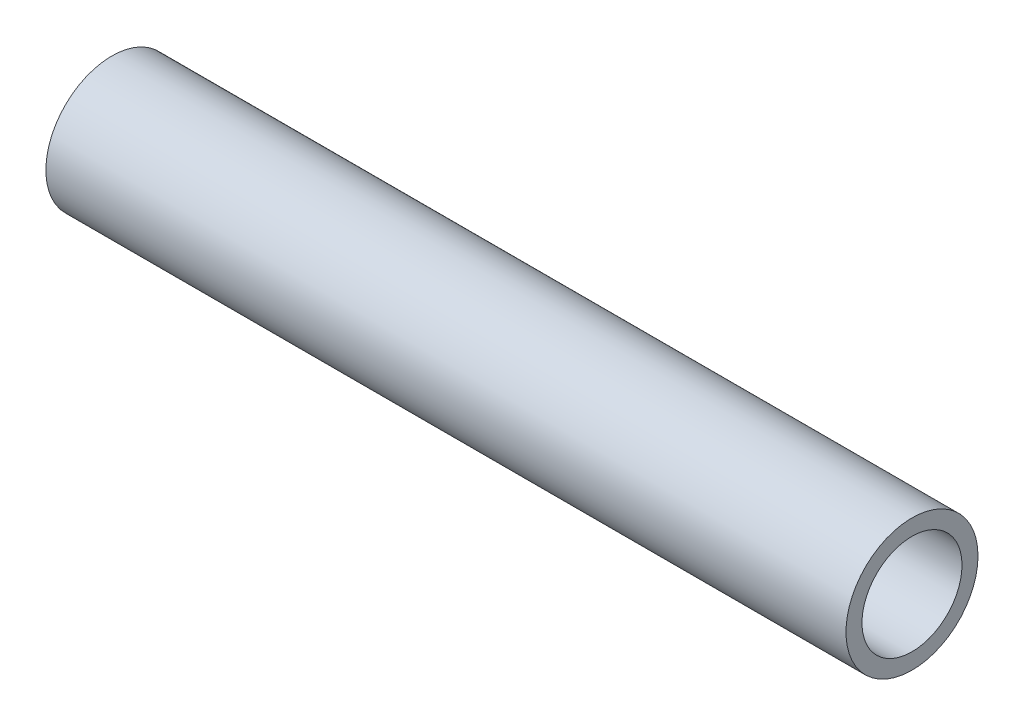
ISO-10303-21;
HEADER;
FILE_DESCRIPTION(('STEP AP214'),'2;1');
FILE_NAME('part.step','',(''),(''),'','','');
FILE_SCHEMA(('AUTOMOTIVE_DESIGN { 1 0 10303 214 1 1 1 1 }'));
ENDSEC;
DATA;
#1=APPLICATION_CONTEXT('core data for automotive mechanical design processes');
#2=APPLICATION_PROTOCOL_DEFINITION('international standard','automotive_design',2000,#1);
#3=PRODUCT_CONTEXT('',#1,'mechanical');
#4=PRODUCT('Part','Part','',(#3));
#5=PRODUCT_RELATED_PRODUCT_CATEGORY('part','',(#4));
#6=PRODUCT_DEFINITION_FORMATION('','',#4);
#7=PRODUCT_DEFINITION_CONTEXT('part definition',#1,'design');
#8=PRODUCT_DEFINITION('design','',#6,#7);
#9=PRODUCT_DEFINITION_SHAPE('','',#8);
#10=(LENGTH_UNIT() NAMED_UNIT(*) SI_UNIT(.MILLI.,.METRE.));
#11=(NAMED_UNIT(*) PLANE_ANGLE_UNIT() SI_UNIT($,.RADIAN.));
#12=(NAMED_UNIT(*) SI_UNIT($,.STERADIAN.) SOLID_ANGLE_UNIT());
#13=UNCERTAINTY_MEASURE_WITH_UNIT(LENGTH_MEASURE(1.E-05),#10,'distance_accuracy_value','');
#14=(GEOMETRIC_REPRESENTATION_CONTEXT(3) GLOBAL_UNCERTAINTY_ASSIGNED_CONTEXT((#13)) GLOBAL_UNIT_ASSIGNED_CONTEXT((#10,
#11,#12)) REPRESENTATION_CONTEXT('',''));
#15=CARTESIAN_POINT('',(0.,0.,0.));
#16=DIRECTION('',(0.,0.,1.));
#17=DIRECTION('',(1.,0.,0.));
#18=AXIS2_PLACEMENT_3D('',#15,#16,#17);
#19=CARTESIAN_POINT('',(100.,0.,0.));
#20=DIRECTION('',(1.,0.,0.));
#21=DIRECTION('',(0.,0.,-1.));
#22=AXIS2_PLACEMENT_3D('',#19,#20,#21);
#23=PLANE('',#22);
#24=CARTESIAN_POINT('',(100.,0.,0.));
#25=DIRECTION('',(1.,0.,0.));
#26=DIRECTION('',(0.,0.,-1.));
#27=AXIS2_PLACEMENT_3D('',#24,#25,#26);
#28=CIRCLE('',#27,8.25);
#29=CARTESIAN_POINT('',(100.,0.,-8.25));
#30=VERTEX_POINT('',#29);
#31=EDGE_CURVE('E10',#30,#30,#28,.T.);
#32=ORIENTED_EDGE('',*,*,#31,.T.);
#33=EDGE_LOOP('',(#32));
#34=FACE_BOUND('',#33,.T.);
#35=CARTESIAN_POINT('',(100.,0.,0.));
#36=DIRECTION('',(1.,0.,0.));
#37=DIRECTION('',(0.,0.,-1.));
#38=AXIS2_PLACEMENT_3D('',#35,#36,#37);
#39=CIRCLE('',#38,6.25);
#40=CARTESIAN_POINT('',(100.,0.,-6.25));
#41=VERTEX_POINT('',#40);
#42=EDGE_CURVE('E45',#41,#41,#39,.T.);
#43=ORIENTED_EDGE('',*,*,#42,.F.);
#44=EDGE_LOOP('',(#43));
#45=FACE_BOUND('',#44,.T.);
#46=ADVANCED_FACE('F34',(#34,#45),#23,.T.);
#47=CARTESIAN_POINT('',(0.,0.,0.));
#48=DIRECTION('',(1.,0.,0.));
#49=DIRECTION('',(0.,0.,-1.));
#50=AXIS2_PLACEMENT_3D('',#47,#48,#49);
#51=PLANE('',#50);
#52=CARTESIAN_POINT('',(0.,0.,0.));
#53=DIRECTION('',(1.,0.,0.));
#54=DIRECTION('',(0.,0.,-1.));
#55=AXIS2_PLACEMENT_3D('',#52,#53,#54);
#56=CIRCLE('',#55,8.25);
#57=CARTESIAN_POINT('',(0.,0.,-8.25));
#58=VERTEX_POINT('',#57);
#59=EDGE_CURVE('E38',#58,#58,#56,.T.);
#60=ORIENTED_EDGE('',*,*,#59,.F.);
#61=EDGE_LOOP('',(#60));
#62=FACE_BOUND('',#61,.T.);
#63=CARTESIAN_POINT('',(0.,0.,0.));
#64=DIRECTION('',(1.,0.,0.));
#65=DIRECTION('',(0.,0.,-1.));
#66=AXIS2_PLACEMENT_3D('',#63,#64,#65);
#67=CIRCLE('',#66,6.25);
#68=CARTESIAN_POINT('',(0.,0.,-6.25));
#69=VERTEX_POINT('',#68);
#70=EDGE_CURVE('E47',#69,#69,#67,.T.);
#71=ORIENTED_EDGE('',*,*,#70,.T.);
#72=EDGE_LOOP('',(#71));
#73=FACE_BOUND('',#72,.T.);
#74=ADVANCED_FACE('F57',(#62,#73),#51,.F.);
#75=CARTESIAN_POINT('',(100.,0.,0.));
#76=DIRECTION('',(-1.,0.,0.));
#77=DIRECTION('',(0.,0.,1.));
#78=AXIS2_PLACEMENT_3D('',#75,#76,#77);
#79=CYLINDRICAL_SURFACE('',#78,8.25);
#80=ORIENTED_EDGE('',*,*,#31,.F.);
#81=EDGE_LOOP('',(#80));
#82=FACE_BOUND('',#81,.T.);
#83=ORIENTED_EDGE('',*,*,#59,.T.);
#84=EDGE_LOOP('',(#83));
#85=FACE_BOUND('',#84,.T.);
#86=ADVANCED_FACE('F36',(#82,#85),#79,.T.);
#87=CARTESIAN_POINT('',(100.,0.,0.));
#88=DIRECTION('',(-1.,0.,0.));
#89=DIRECTION('',(0.,0.,1.));
#90=AXIS2_PLACEMENT_3D('',#87,#88,#89);
#91=CYLINDRICAL_SURFACE('',#90,6.25);
#92=ORIENTED_EDGE('',*,*,#42,.T.);
#93=EDGE_LOOP('',(#92));
#94=FACE_BOUND('',#93,.T.);
#95=ORIENTED_EDGE('',*,*,#70,.F.);
#96=EDGE_LOOP('',(#95));
#97=FACE_BOUND('',#96,.T.);
#98=ADVANCED_FACE('F53',(#94,#97),#91,.F.);
#99=CLOSED_SHELL('',(#46,#74,#86,#98));
#100=MANIFOLD_SOLID_BREP('B2',#99);
#101=ADVANCED_BREP_SHAPE_REPRESENTATION('',(#18,#100),#14);
#102=SHAPE_DEFINITION_REPRESENTATION(#9,#101);
ENDSEC;
END-ISO-10303-21;
